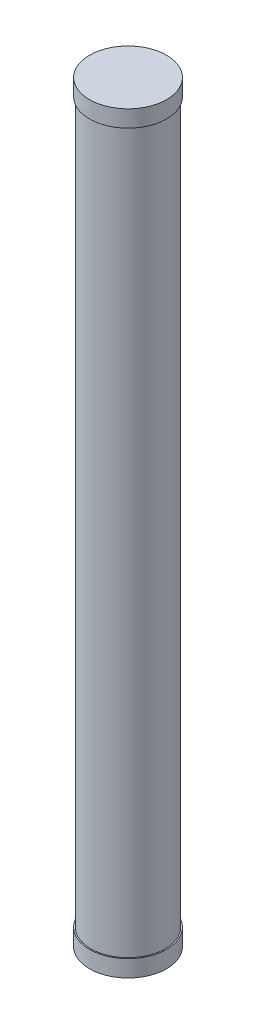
from build123d import *

# Parameters (mm, degrees)
CROQUIS2_R              = 30
SALIENTE_EXTRUIR1_DEPTH = 301.5
CROQUIS3_R              = 31
SALIENTE_EXTRUIR2_DEPTH = 1.5
CROQUIS4_R              = 31
CROQUIS4_R_2            = 30
SALIENTE_EXTRUIR3_DEPTH = 12


with BuildPart() as part:
    # Croquis2 → Saliente-Extruir1 (new, symmetric)
    with BuildSketch(Plane(origin=(0, 0, 0), x_dir=(1, 0, 0), z_dir=(0, 1, 0))):
        with Locations(Location((0, 0, 0), (0, 0, 270))):
            Circle(CROQUIS2_R)
    extrude(amount=SALIENTE_EXTRUIR1_DEPTH, both=True)


with BuildPart() as body_2:
    # Croquis3 → Saliente-Extruir2 (new body)
    with BuildSketch(Plane(origin=(0, 301.5, 0), x_dir=(1, 0, 0), z_dir=(0, 1, 0))):
        with Locations(Location((0, 0, 0), (0, 0, 270))):
            Circle(CROQUIS3_R)
    extrude(amount=SALIENTE_EXTRUIR2_DEPTH)

    # Croquis4 → Saliente-Extruir3 (add)
    with BuildSketch(Plane.XZ.offset(-301.5)):
        with Locations(Location((0, 0, 0), (0, 0, 270))):
            Circle(CROQUIS4_R)
        with Locations(Location((0, 0, 0), (0, 0, 270))):
            Circle(CROQUIS4_R_2, mode=Mode.SUBTRACT)
    extrude(amount=SALIENTE_EXTRUIR3_DEPTH)


with BuildPart() as body_3:
    # Simetr_a2: mirrored copy
    add(body_2.part.mirror(Plane.ZX))


solid = Compound([part.part, body_2.part, body_3.part])
